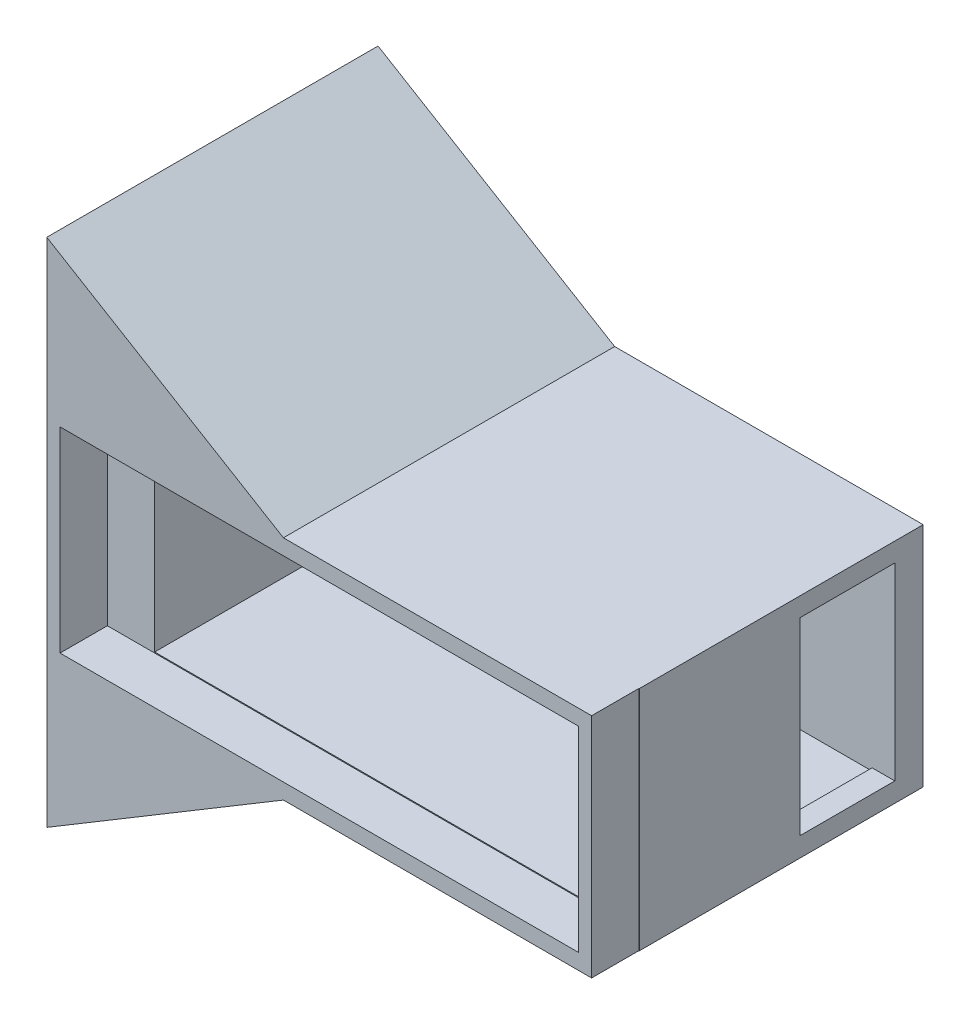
from build123d import *

# Parameters (mm, degrees)
SKETCH2_W           = 57.6
SKETCH2_H           = 24
BOSS_EXTRUDE1_DEPTH = 30
SKETCH5_W           = 44.8
SKETCH5_H           = 20.5
CUT_EXTRUDE1_DEPTH  = 27
SKETCH10_W          = 57.563247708
SKETCH10_H          = 24
BOSS_EXTRUDE2_DEPTH = 5
SKETCH11_W          = 54.8
SKETCH11_H          = 20.7
CUT_EXTRUDE3_DEPTH  = 5
CUT_EXTRUDE4_DEPTH  = 6.4
SKETCH16_W          = 4
SKETCH16_H          = 20.5
CUT_EXTRUDE5_DEPTH  = 27
BOSS_EXTRUDE3_DEPTH = 35


with BuildPart() as part:
    # Sketch2 → Boss-Extrude1 (new body)
    with BuildSketch(Plane.XY):
        Rectangle(SKETCH2_W, SKETCH2_H)
    extrude(amount=BOSS_EXTRUDE1_DEPTH)

    # Sketch5 → Cut-Extrude1 (cut)
    with BuildSketch(Plane.XY.offset(30)):
        Rectangle(SKETCH5_W, SKETCH5_H)
    extrude(amount=-CUT_EXTRUDE1_DEPTH, mode=Mode.SUBTRACT)

    # Sketch10 → Boss-Extrude2 (add)
    with BuildSketch(Plane.XY.offset(30)):
        with Locations((-0.018376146, 0)):
            Rectangle(SKETCH10_W, SKETCH10_H)
    extrude(amount=BOSS_EXTRUDE2_DEPTH)

    # Sketch11 → Cut-Extrude3 (cut)
    with BuildSketch(Plane.XY.offset(35)):
        Rectangle(SKETCH11_W, SKETCH11_H)
    extrude(amount=-CUT_EXTRUDE3_DEPTH, mode=Mode.SUBTRACT)

    # Sketch15 → Cut-Extrude4 (cut)
    with BuildSketch(Plane(origin=(28.8, 0, 0), x_dir=(0, 0, -1), z_dir=(1, 0, 0))):
        Polygon((-3, -0.002939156), (-3, -9.94817546), (-13, -9.94817546), (-13, 9.997060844), (-3, 9.997060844), align=None)
    extrude(amount=-CUT_EXTRUDE4_DEPTH, mode=Mode.SUBTRACT)

    # Sketch16 → Cut-Extrude5 (cut)
    with BuildSketch(Plane.XY.offset(30)):
        with Locations((24.4, 0)):
            Rectangle(SKETCH16_W, SKETCH16_H)
    extrude(amount=-CUT_EXTRUDE5_DEPTH, mode=Mode.SUBTRACT)

    # Sketch17 → Boss-Extrude3 (add, through all)
    with BuildSketch(Plane.XY):
        Polygon((-28.8, 12), (-28.8, 27), (-3.8, 12), align=None)
        Polygon((-28.8, -27), (-3.8, -12), (-28.8, -12), align=None)
    extrude(amount=BOSS_EXTRUDE3_DEPTH)


solid = part.part
